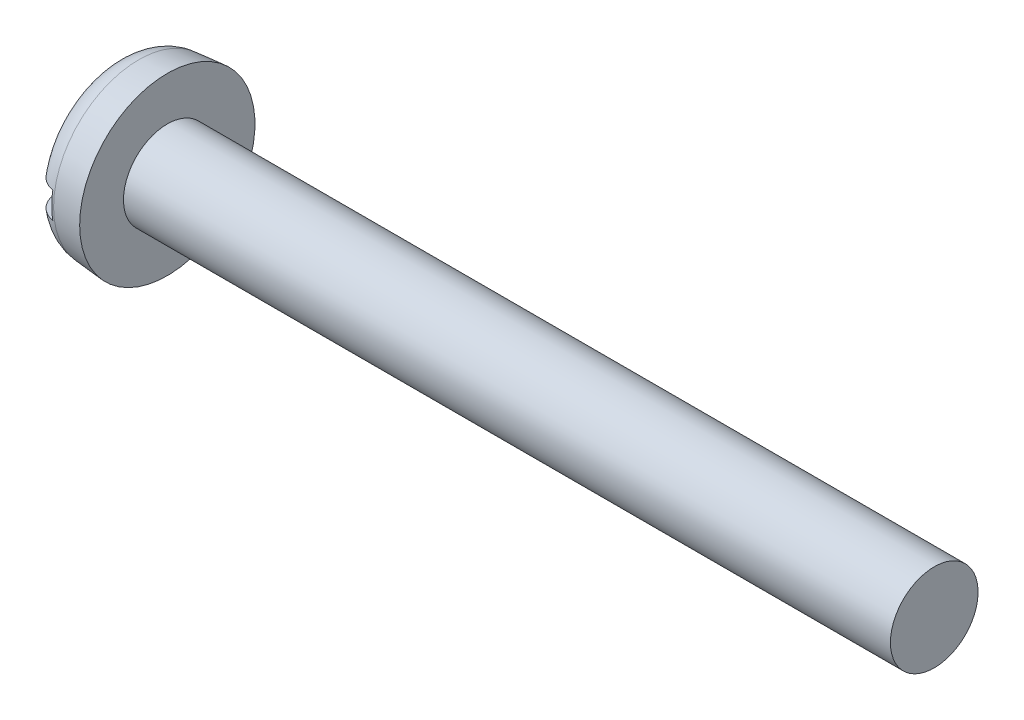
from build123d import *

# Parameters (mm, degrees)
FILLET2_R  = 1.2
SKETCH2_W  = 8
SKETCH2_H  = 1.2
SLOT_DEPTH = 1


with BuildPart() as part:
    # BodySke → Base-Revolve (revolve)
    with BuildSketch(Plane.XY, mode=Mode.PRIVATE) as base_revolve_sk:
        Polygon((2.4, 2), (2.4, 4), (0, 3.790027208), (0, 0), (37.4, 0), (37.4, 2), align=None)
    revolve(base_revolve_sk.sketch.rotate(Axis((-25.4, 0, 0), (1, 0, 0)), 90), axis=Axis((-25.4, 0, 0), (1, 0, 0)))

    # Fillet2
    fillet2_edges = [part.edges().sort_by_distance(p)[0] for p in [
        (0, 0, -3.790027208),
    ]]
    fillet(fillet2_edges, radius=FILLET2_R)

    # Sketch2 → Slot (cut)
    with BuildSketch(Plane(origin=(0, 0, 0), x_dir=(0, 0, -1), z_dir=(1, 0, 0))):
        Rectangle(SKETCH2_W, SKETCH2_H)
    extrude(amount=SLOT_DEPTH, mode=Mode.SUBTRACT)


solid = part.part
